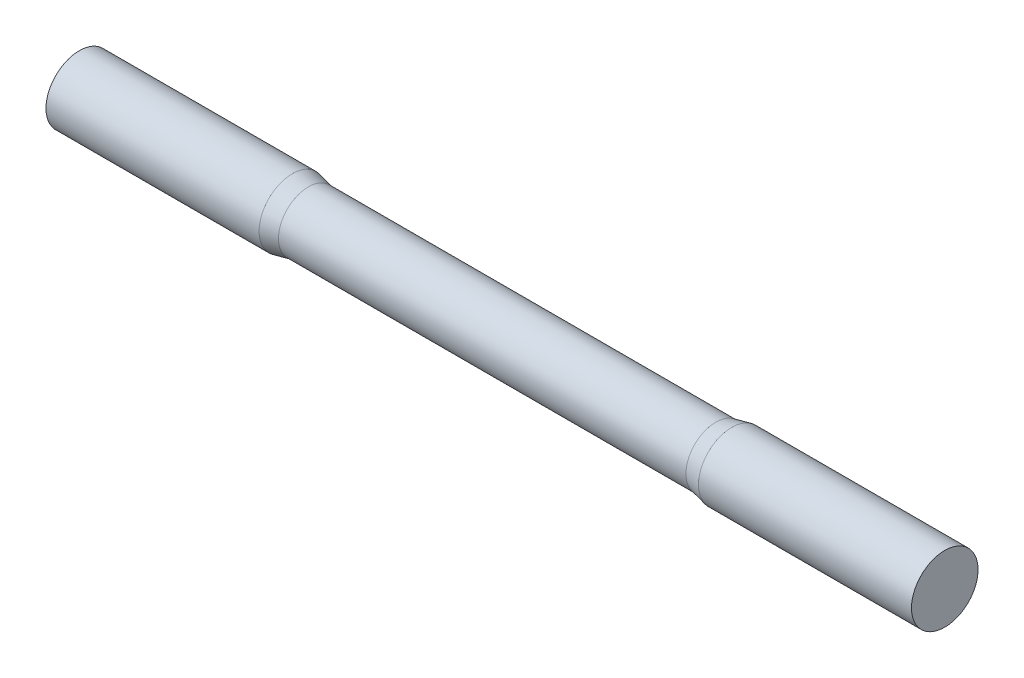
ISO-10303-21;
HEADER;
FILE_DESCRIPTION(('STEP AP214'),'2;1');
FILE_NAME('part.step','',(''),(''),'','','');
FILE_SCHEMA(('AUTOMOTIVE_DESIGN { 1 0 10303 214 1 1 1 1 }'));
ENDSEC;
DATA;
#1=APPLICATION_CONTEXT('core data for automotive mechanical design processes');
#2=APPLICATION_PROTOCOL_DEFINITION('international standard','automotive_design',2000,#1);
#3=PRODUCT_CONTEXT('',#1,'mechanical');
#4=PRODUCT('Part','Part','',(#3));
#5=PRODUCT_RELATED_PRODUCT_CATEGORY('part','',(#4));
#6=PRODUCT_DEFINITION_FORMATION('','',#4);
#7=PRODUCT_DEFINITION_CONTEXT('part definition',#1,'design');
#8=PRODUCT_DEFINITION('design','',#6,#7);
#9=PRODUCT_DEFINITION_SHAPE('','',#8);
#10=(LENGTH_UNIT() NAMED_UNIT(*) SI_UNIT(.MILLI.,.METRE.));
#11=(NAMED_UNIT(*) PLANE_ANGLE_UNIT() SI_UNIT($,.RADIAN.));
#12=(NAMED_UNIT(*) SI_UNIT($,.STERADIAN.) SOLID_ANGLE_UNIT());
#13=UNCERTAINTY_MEASURE_WITH_UNIT(LENGTH_MEASURE(1.E-05),#10,'distance_accuracy_value','');
#14=(GEOMETRIC_REPRESENTATION_CONTEXT(3) GLOBAL_UNCERTAINTY_ASSIGNED_CONTEXT((#13)) GLOBAL_UNIT_ASSIGNED_CONTEXT((#10,
#11,#12)) REPRESENTATION_CONTEXT('',''));
#15=CARTESIAN_POINT('',(0.,0.,0.));
#16=DIRECTION('',(0.,0.,1.));
#17=DIRECTION('',(1.,0.,0.));
#18=AXIS2_PLACEMENT_3D('',#15,#16,#17);
#19=CARTESIAN_POINT('',(65.,0.,0.));
#20=DIRECTION('',(-1.,0.,0.));
#21=DIRECTION('',(0.,0.,1.));
#22=AXIS2_PLACEMENT_3D('',#19,#20,#21);
#23=CYLINDRICAL_SURFACE('',#22,2.24);
#24=CARTESIAN_POINT('',(47.8,0.,0.));
#25=DIRECTION('',(1.,0.,0.));
#26=DIRECTION('',(0.,0.,-1.));
#27=AXIS2_PLACEMENT_3D('',#24,#25,#26);
#28=CIRCLE('',#27,2.24);
#29=CARTESIAN_POINT('',(47.8,0.,-2.24));
#30=VERTEX_POINT('',#29);
#31=EDGE_CURVE('E49',#30,#30,#28,.T.);
#32=ORIENTED_EDGE('',*,*,#31,.F.);
#33=EDGE_LOOP('',(#32));
#34=FACE_BOUND('',#33,.T.);
#35=CARTESIAN_POINT('',(17.2,0.,0.));
#36=DIRECTION('',(-1.,0.,0.));
#37=DIRECTION('',(0.,0.,1.));
#38=AXIS2_PLACEMENT_3D('',#35,#36,#37);
#39=CIRCLE('',#38,2.24);
#40=CARTESIAN_POINT('',(17.2,0.,2.24));
#41=VERTEX_POINT('',#40);
#42=EDGE_CURVE('E10',#41,#41,#39,.T.);
#43=ORIENTED_EDGE('',*,*,#42,.F.);
#44=EDGE_LOOP('',(#43));
#45=FACE_BOUND('',#44,.T.);
#46=ADVANCED_FACE('F43',(#34,#45),#23,.T.);
#47=CARTESIAN_POINT('',(-0.442011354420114,0.,0.));
#48=DIRECTION('',(-1.,0.,0.));
#49=DIRECTION('',(0.,0.,1.));
#50=AXIS2_PLACEMENT_3D('',#47,#48,#49);
#51=CYLINDRICAL_SURFACE('',#50,2.5);
#52=CARTESIAN_POINT('',(49.,0.,0.));
#53=DIRECTION('',(-1.,0.,0.));
#54=DIRECTION('',(0.,0.,1.));
#55=AXIS2_PLACEMENT_3D('',#52,#53,#54);
#56=CIRCLE('',#55,2.5);
#57=CARTESIAN_POINT('',(49.,0.,2.5));
#58=VERTEX_POINT('',#57);
#59=EDGE_CURVE('E57',#58,#58,#56,.T.);
#60=ORIENTED_EDGE('',*,*,#59,.F.);
#61=EDGE_LOOP('',(#60));
#62=FACE_BOUND('',#61,.T.);
#63=CARTESIAN_POINT('',(65.,0.,0.));
#64=DIRECTION('',(-1.,0.,0.));
#65=DIRECTION('',(0.,0.,1.));
#66=AXIS2_PLACEMENT_3D('',#63,#64,#65);
#67=CIRCLE('',#66,2.5);
#68=CARTESIAN_POINT('',(65.,0.,2.5));
#69=VERTEX_POINT('',#68);
#70=EDGE_CURVE('E53',#69,#69,#67,.T.);
#71=ORIENTED_EDGE('',*,*,#70,.T.);
#72=EDGE_LOOP('',(#71));
#73=FACE_BOUND('',#72,.T.);
#74=ADVANCED_FACE('F85',(#62,#73),#51,.T.);
#75=CARTESIAN_POINT('',(49.,0.,0.));
#76=DIRECTION('',(1.,0.,0.));
#77=DIRECTION('',(0.,0.,-1.));
#78=AXIS2_PLACEMENT_3D('',#75,#76,#77);
#79=CONICAL_SURFACE('',#78,2.5,0.213368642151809);
#80=ORIENTED_EDGE('',*,*,#31,.T.);
#81=EDGE_LOOP('',(#80));
#82=FACE_BOUND('',#81,.T.);
#83=ORIENTED_EDGE('',*,*,#59,.T.);
#84=EDGE_LOOP('',(#83));
#85=FACE_BOUND('',#84,.T.);
#86=ADVANCED_FACE('F91',(#82,#85),#79,.T.);
#87=CARTESIAN_POINT('',(65.,0.,0.));
#88=DIRECTION('',(1.,0.,0.));
#89=DIRECTION('',(0.,0.,-1.));
#90=AXIS2_PLACEMENT_3D('',#87,#88,#89);
#91=PLANE('',#90);
#92=ORIENTED_EDGE('',*,*,#70,.F.);
#93=EDGE_LOOP('',(#92));
#94=FACE_BOUND('',#93,.T.);
#95=ADVANCED_FACE('F81',(#94),#91,.T.);
#96=CARTESIAN_POINT('',(-0.37712895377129,0.,0.));
#97=DIRECTION('',(-1.,0.,0.));
#98=DIRECTION('',(0.,0.,1.));
#99=AXIS2_PLACEMENT_3D('',#96,#97,#98);
#100=CYLINDRICAL_SURFACE('',#99,2.5);
#101=CARTESIAN_POINT('',(0.,0.,0.));
#102=DIRECTION('',(-1.,0.,0.));
#103=DIRECTION('',(0.,0.,1.));
#104=AXIS2_PLACEMENT_3D('',#101,#102,#103);
#105=CIRCLE('',#104,2.5);
#106=CARTESIAN_POINT('',(0.,0.,2.5));
#107=VERTEX_POINT('',#106);
#108=EDGE_CURVE('E62',#107,#107,#105,.T.);
#109=ORIENTED_EDGE('',*,*,#108,.F.);
#110=EDGE_LOOP('',(#109));
#111=FACE_BOUND('',#110,.T.);
#112=CARTESIAN_POINT('',(16.,0.,0.));
#113=DIRECTION('',(-1.,0.,0.));
#114=DIRECTION('',(0.,0.,1.));
#115=AXIS2_PLACEMENT_3D('',#112,#113,#114);
#116=CIRCLE('',#115,2.5);
#117=CARTESIAN_POINT('',(16.,0.,2.5));
#118=VERTEX_POINT('',#117);
#119=EDGE_CURVE('E65',#118,#118,#116,.T.);
#120=ORIENTED_EDGE('',*,*,#119,.T.);
#121=EDGE_LOOP('',(#120));
#122=FACE_BOUND('',#121,.T.);
#123=ADVANCED_FACE('F69',(#111,#122),#100,.T.);
#124=CARTESIAN_POINT('',(17.2,0.,0.));
#125=DIRECTION('',(-1.,0.,0.));
#126=DIRECTION('',(0.,0.,1.));
#127=AXIS2_PLACEMENT_3D('',#124,#125,#126);
#128=CONICAL_SURFACE('',#127,2.24,0.213368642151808);
#129=ORIENTED_EDGE('',*,*,#119,.F.);
#130=EDGE_LOOP('',(#129));
#131=FACE_BOUND('',#130,.T.);
#132=ORIENTED_EDGE('',*,*,#42,.T.);
#133=EDGE_LOOP('',(#132));
#134=FACE_BOUND('',#133,.T.);
#135=ADVANCED_FACE('F71',(#131,#134),#128,.T.);
#136=CARTESIAN_POINT('',(0.,0.,0.));
#137=DIRECTION('',(1.,0.,0.));
#138=DIRECTION('',(0.,0.,-1.));
#139=AXIS2_PLACEMENT_3D('',#136,#137,#138);
#140=PLANE('',#139);
#141=ORIENTED_EDGE('',*,*,#108,.T.);
#142=EDGE_LOOP('',(#141));
#143=FACE_BOUND('',#142,.T.);
#144=ADVANCED_FACE('F73',(#143),#140,.F.);
#145=CLOSED_SHELL('',(#46,#74,#86,#95,#123,#135,#144));
#146=MANIFOLD_SOLID_BREP('B2',#145);
#147=ADVANCED_BREP_SHAPE_REPRESENTATION('',(#18,#146),#14);
#148=SHAPE_DEFINITION_REPRESENTATION(#9,#147);
ENDSEC;
END-ISO-10303-21;
